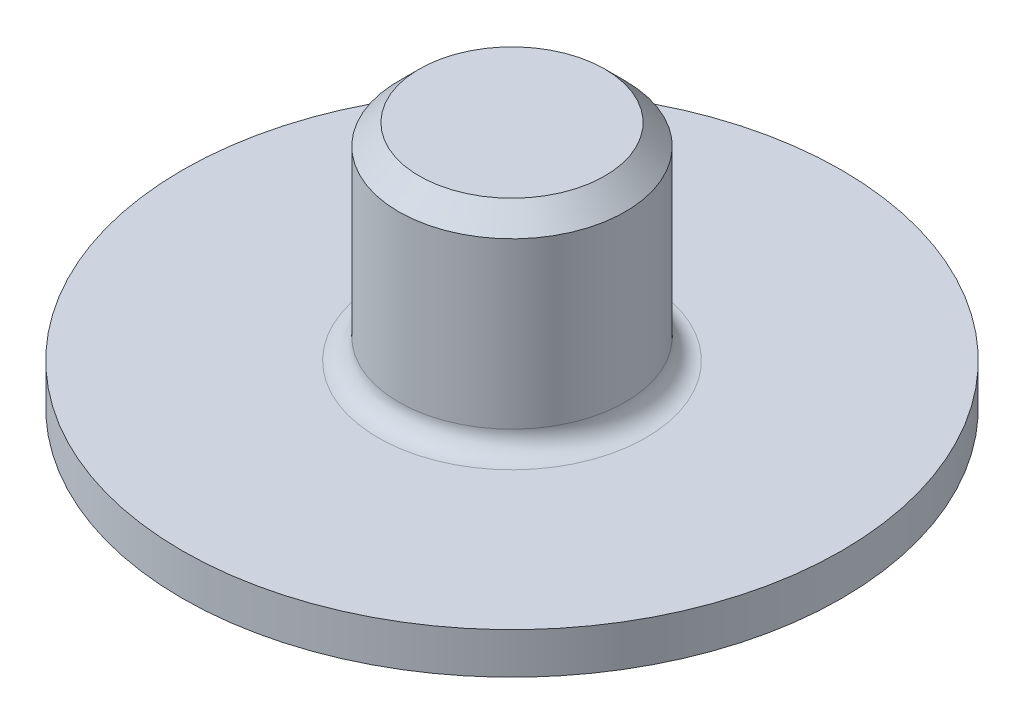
ISO-10303-21;
HEADER;
FILE_DESCRIPTION(('STEP AP214'),'2;1');
FILE_NAME('part.step','',(''),(''),'','','');
FILE_SCHEMA(('AUTOMOTIVE_DESIGN { 1 0 10303 214 1 1 1 1 }'));
ENDSEC;
DATA;
#1=APPLICATION_CONTEXT('core data for automotive mechanical design processes');
#2=APPLICATION_PROTOCOL_DEFINITION('international standard','automotive_design',2000,#1);
#3=PRODUCT_CONTEXT('',#1,'mechanical');
#4=PRODUCT('Part','Part','',(#3));
#5=PRODUCT_RELATED_PRODUCT_CATEGORY('part','',(#4));
#6=PRODUCT_DEFINITION_FORMATION('','',#4);
#7=PRODUCT_DEFINITION_CONTEXT('part definition',#1,'design');
#8=PRODUCT_DEFINITION('design','',#6,#7);
#9=PRODUCT_DEFINITION_SHAPE('','',#8);
#10=(LENGTH_UNIT() NAMED_UNIT(*) SI_UNIT(.MILLI.,.METRE.));
#11=(NAMED_UNIT(*) PLANE_ANGLE_UNIT() SI_UNIT($,.RADIAN.));
#12=(NAMED_UNIT(*) SI_UNIT($,.STERADIAN.) SOLID_ANGLE_UNIT());
#13=UNCERTAINTY_MEASURE_WITH_UNIT(LENGTH_MEASURE(1.E-05),#10,'distance_accuracy_value','');
#14=(GEOMETRIC_REPRESENTATION_CONTEXT(3) GLOBAL_UNCERTAINTY_ASSIGNED_CONTEXT((#13)) GLOBAL_UNIT_ASSIGNED_CONTEXT((#10,
#11,#12)) REPRESENTATION_CONTEXT('',''));
#15=CARTESIAN_POINT('',(0.,0.,0.));
#16=DIRECTION('',(0.,0.,1.));
#17=DIRECTION('',(1.,0.,0.));
#18=AXIS2_PLACEMENT_3D('',#15,#16,#17);
#19=CARTESIAN_POINT('',(-5.5,12.,0.));
#20=DIRECTION('',(0.,-1.,0.));
#21=DIRECTION('',(0.,0.,-1.));
#22=AXIS2_PLACEMENT_3D('',#19,#20,#21);
#23=PLANE('',#22);
#24=CARTESIAN_POINT('',(0.,12.,0.));
#25=DIRECTION('',(0.,-1.,0.));
#26=DIRECTION('',(0.,0.,-1.));
#27=AXIS2_PLACEMENT_3D('',#24,#25,#26);
#28=CIRCLE('',#27,4.5);
#29=CARTESIAN_POINT('',(0.,12.,-4.5));
#30=VERTEX_POINT('',#29);
#31=EDGE_CURVE('E39',#30,#30,#28,.F.);
#32=ORIENTED_EDGE('',*,*,#31,.T.);
#33=EDGE_LOOP('',(#32));
#34=FACE_BOUND('',#33,.T.);
#35=ADVANCED_FACE('F29',(#34),#23,.F.);
#36=CARTESIAN_POINT('',(0.,0.,0.));
#37=DIRECTION('',(0.,-1.,0.));
#38=DIRECTION('',(0.,0.,-1.));
#39=AXIS2_PLACEMENT_3D('',#36,#37,#38);
#40=CYLINDRICAL_SURFACE('',#39,5.5);
#41=CARTESIAN_POINT('',(0.,3.,0.));
#42=DIRECTION('',(0.,-1.,0.));
#43=DIRECTION('',(0.,0.,-1.));
#44=AXIS2_PLACEMENT_3D('',#41,#42,#43);
#45=CIRCLE('',#44,5.5);
#46=CARTESIAN_POINT('',(0.,3.,-5.5));
#47=VERTEX_POINT('',#46);
#48=EDGE_CURVE('E10',#47,#47,#45,.F.);
#49=ORIENTED_EDGE('',*,*,#48,.T.);
#50=EDGE_LOOP('',(#49));
#51=FACE_BOUND('',#50,.T.);
#52=CARTESIAN_POINT('',(0.,11.,0.));
#53=DIRECTION('',(0.,-1.,0.));
#54=DIRECTION('',(0.,0.,-1.));
#55=AXIS2_PLACEMENT_3D('',#52,#53,#54);
#56=CIRCLE('',#55,5.5);
#57=CARTESIAN_POINT('',(0.,11.,-5.5));
#58=VERTEX_POINT('',#57);
#59=EDGE_CURVE('E43',#58,#58,#56,.T.);
#60=ORIENTED_EDGE('',*,*,#59,.T.);
#61=EDGE_LOOP('',(#60));
#62=FACE_BOUND('',#61,.T.);
#63=ADVANCED_FACE('F65',(#51,#62),#40,.T.);
#64=CARTESIAN_POINT('',(-16.,2.,0.));
#65=DIRECTION('',(0.,-1.,0.));
#66=DIRECTION('',(0.,0.,-1.));
#67=AXIS2_PLACEMENT_3D('',#64,#65,#66);
#68=PLANE('',#67);
#69=CARTESIAN_POINT('',(0.,2.,0.));
#70=DIRECTION('',(0.,-1.,0.));
#71=DIRECTION('',(0.,0.,-1.));
#72=AXIS2_PLACEMENT_3D('',#69,#70,#71);
#73=CIRCLE('',#72,6.5);
#74=CARTESIAN_POINT('',(0.,2.,-6.5));
#75=VERTEX_POINT('',#74);
#76=EDGE_CURVE('E35',#75,#75,#73,.T.);
#77=ORIENTED_EDGE('',*,*,#76,.T.);
#78=EDGE_LOOP('',(#77));
#79=FACE_BOUND('',#78,.T.);
#80=CARTESIAN_POINT('',(0.,2.,0.));
#81=DIRECTION('',(0.,-1.,0.));
#82=DIRECTION('',(0.,0.,-1.));
#83=AXIS2_PLACEMENT_3D('',#80,#81,#82);
#84=CIRCLE('',#83,16.);
#85=CARTESIAN_POINT('',(0.,2.,-16.));
#86=VERTEX_POINT('',#85);
#87=EDGE_CURVE('E48',#86,#86,#84,.T.);
#88=ORIENTED_EDGE('',*,*,#87,.F.);
#89=EDGE_LOOP('',(#88));
#90=FACE_BOUND('',#89,.T.);
#91=ADVANCED_FACE('F60',(#79,#90),#68,.F.);
#92=CARTESIAN_POINT('',(0.,0.,0.));
#93=DIRECTION('',(0.,-1.,0.));
#94=DIRECTION('',(0.,0.,-1.));
#95=AXIS2_PLACEMENT_3D('',#92,#93,#94);
#96=CYLINDRICAL_SURFACE('',#95,16.);
#97=CARTESIAN_POINT('',(0.,0.,0.));
#98=DIRECTION('',(0.,-1.,0.));
#99=DIRECTION('',(0.,0.,-1.));
#100=AXIS2_PLACEMENT_3D('',#97,#98,#99);
#101=CIRCLE('',#100,16.);
#102=CARTESIAN_POINT('',(0.,0.,-16.));
#103=VERTEX_POINT('',#102);
#104=EDGE_CURVE('E51',#103,#103,#101,.T.);
#105=ORIENTED_EDGE('',*,*,#104,.F.);
#106=EDGE_LOOP('',(#105));
#107=FACE_BOUND('',#106,.T.);
#108=ORIENTED_EDGE('',*,*,#87,.T.);
#109=EDGE_LOOP('',(#108));
#110=FACE_BOUND('',#109,.T.);
#111=ADVANCED_FACE('F57',(#107,#110),#96,.T.);
#112=CARTESIAN_POINT('',(0.,0.,0.));
#113=DIRECTION('',(0.,1.,0.));
#114=DIRECTION('',(0.,0.,1.));
#115=AXIS2_PLACEMENT_3D('',#112,#113,#114);
#116=PLANE('',#115);
#117=ORIENTED_EDGE('',*,*,#104,.T.);
#118=EDGE_LOOP('',(#117));
#119=FACE_BOUND('',#118,.T.);
#120=ADVANCED_FACE('F55',(#119),#116,.F.);
#121=CARTESIAN_POINT('',(0.,11.,0.));
#122=DIRECTION('',(0.,-1.,0.));
#123=DIRECTION('',(0.,0.,-1.));
#124=AXIS2_PLACEMENT_3D('',#121,#122,#123);
#125=CONICAL_SURFACE('',#124,5.5,0.785398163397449);
#126=ORIENTED_EDGE('',*,*,#31,.F.);
#127=EDGE_LOOP('',(#126));
#128=FACE_BOUND('',#127,.T.);
#129=ORIENTED_EDGE('',*,*,#59,.F.);
#130=EDGE_LOOP('',(#129));
#131=FACE_BOUND('',#130,.T.);
#132=ADVANCED_FACE('F76',(#128,#131),#125,.T.);
#133=CARTESIAN_POINT('',(0.,3.,0.));
#134=DIRECTION('',(0.,-1.,0.));
#135=DIRECTION('',(0.,0.,-1.));
#136=AXIS2_PLACEMENT_3D('',#133,#134,#135);
#137=TOROIDAL_SURFACE('',#136,6.5,1.);
#138=ORIENTED_EDGE('',*,*,#48,.F.);
#139=EDGE_LOOP('',(#138));
#140=FACE_BOUND('',#139,.T.);
#141=ORIENTED_EDGE('',*,*,#76,.F.);
#142=EDGE_LOOP('',(#141));
#143=FACE_BOUND('',#142,.T.);
#144=ADVANCED_FACE('F79',(#140,#143),#137,.F.);
#145=CLOSED_SHELL('',(#35,#63,#91,#111,#120,#132,#144));
#146=MANIFOLD_SOLID_BREP('B2',#145);
#147=ADVANCED_BREP_SHAPE_REPRESENTATION('',(#18,#146),#14);
#148=SHAPE_DEFINITION_REPRESENTATION(#9,#147);
ENDSEC;
END-ISO-10303-21;
